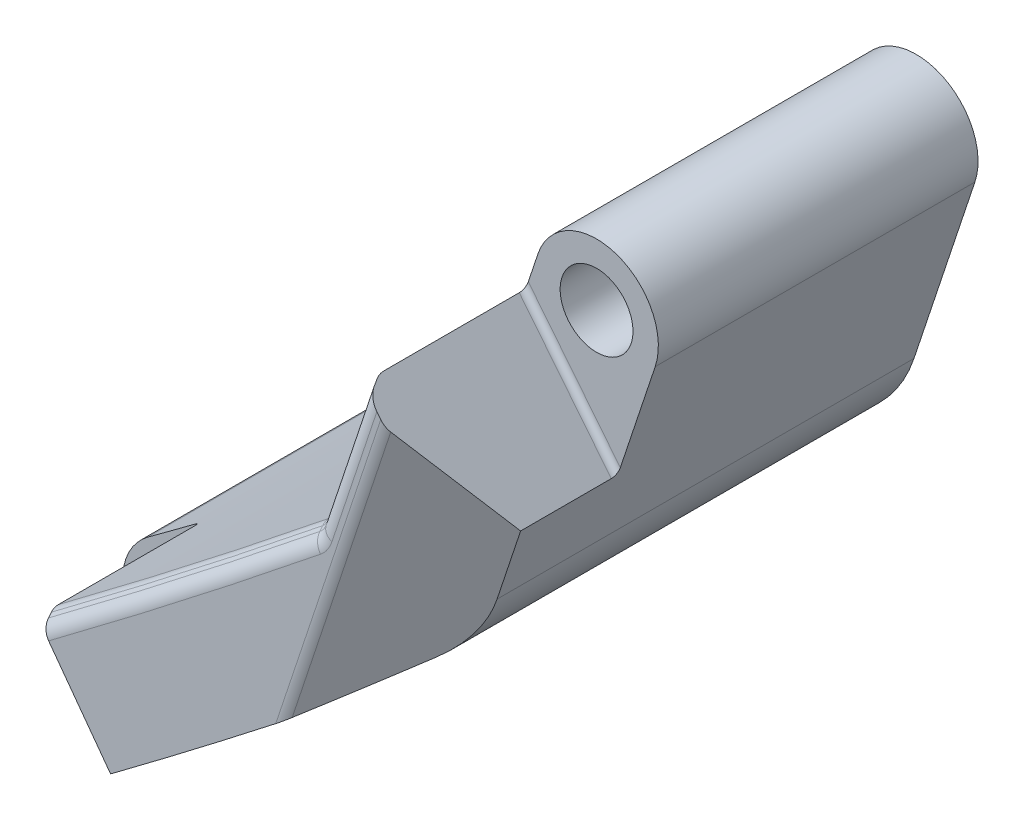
ISO-10303-21;
HEADER;
FILE_DESCRIPTION(('STEP AP214'),'2;1');
FILE_NAME('part.step','',(''),(''),'','','');
FILE_SCHEMA(('AUTOMOTIVE_DESIGN { 1 0 10303 214 1 1 1 1 }'));
ENDSEC;
DATA;
#1=APPLICATION_CONTEXT('core data for automotive mechanical design processes');
#2=APPLICATION_PROTOCOL_DEFINITION('international standard','automotive_design',2000,#1);
#3=PRODUCT_CONTEXT('',#1,'mechanical');
#4=PRODUCT('Part','Part','',(#3));
#5=PRODUCT_RELATED_PRODUCT_CATEGORY('part','',(#4));
#6=PRODUCT_DEFINITION_FORMATION('','',#4);
#7=PRODUCT_DEFINITION_CONTEXT('part definition',#1,'design');
#8=PRODUCT_DEFINITION('design','',#6,#7);
#9=PRODUCT_DEFINITION_SHAPE('','',#8);
#10=(LENGTH_UNIT() NAMED_UNIT(*) SI_UNIT(.MILLI.,.METRE.));
#11=(NAMED_UNIT(*) PLANE_ANGLE_UNIT() SI_UNIT($,.RADIAN.));
#12=(NAMED_UNIT(*) SI_UNIT($,.STERADIAN.) SOLID_ANGLE_UNIT());
#13=UNCERTAINTY_MEASURE_WITH_UNIT(LENGTH_MEASURE(1.E-05),#10,'distance_accuracy_value','');
#14=(GEOMETRIC_REPRESENTATION_CONTEXT(3) GLOBAL_UNCERTAINTY_ASSIGNED_CONTEXT((#13)) GLOBAL_UNIT_ASSIGNED_CONTEXT((#10,
#11,#12)) REPRESENTATION_CONTEXT('',''));
#15=CARTESIAN_POINT('',(0.,0.,0.));
#16=DIRECTION('',(0.,0.,1.));
#17=DIRECTION('',(1.,0.,0.));
#18=AXIS2_PLACEMENT_3D('',#15,#16,#17);
#19=CARTESIAN_POINT('',(-474.213638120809,-43.9648384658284,-31.75));
#20=DIRECTION('',(0.,0.,-1.));
#21=DIRECTION('',(-1.,0.,0.));
#22=AXIS2_PLACEMENT_3D('',#19,#20,#21);
#23=PLANE('',#22);
#24=CARTESIAN_POINT('',(-495.568692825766,-68.0283667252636,-31.75));
#25=DIRECTION('',(0.,0.,1.));
#26=DIRECTION('',(1.,0.,0.));
#27=AXIS2_PLACEMENT_3D('',#24,#25,#26);
#28=CIRCLE('',#27,2.8067);
#29=CARTESIAN_POINT('',(-492.761992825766,-68.0283667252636,-31.75));
#30=VERTEX_POINT('',#29);
#31=EDGE_CURVE('E599',#30,#30,#28,.T.);
#32=ORIENTED_EDGE('',*,*,#31,.T.);
#33=EDGE_LOOP('',(#32));
#34=FACE_BOUND('',#33,.T.);
#35=CARTESIAN_POINT('',(-474.213638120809,-43.9648384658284,-31.75));
#36=DIRECTION('',(0.,0.,-1.));
#37=DIRECTION('',(-1.,0.,0.));
#38=AXIS2_PLACEMENT_3D('',#35,#36,#37);
#39=CIRCLE('',#38,1.26999999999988);
#40=CARTESIAN_POINT('',(-473.008502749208,-44.3655237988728,-31.75));
#41=VERTEX_POINT('',#40);
#42=CARTESIAN_POINT('',(-473.416148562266,-44.9532262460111,-31.75));
#43=VERTEX_POINT('',#42);
#44=EDGE_CURVE('E529',#41,#43,#39,.T.);
#45=ORIENTED_EDGE('',*,*,#44,.F.);
#46=DIRECTION('',(-0.31550026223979,-0.948925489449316,0.));
#47=VECTOR('',#46,1.);
#48=CARTESIAN_POINT('',(-468.314496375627,-30.247430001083,-31.75));
#49=LINE('',#48,#47);
#50=CARTESIAN_POINT('',(-468.314496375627,-30.247430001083,-31.75));
#51=VERTEX_POINT('',#50);
#52=EDGE_CURVE('E250',#51,#41,#49,.T.);
#53=ORIENTED_EDGE('',*,*,#52,.F.);
#54=CARTESIAN_POINT('',(-463.795238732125,-31.75,-31.75));
#55=DIRECTION('',(0.,0.,1.));
#56=DIRECTION('',(1.,0.,0.));
#57=AXIS2_PLACEMENT_3D('',#54,#55,#56);
#58=CIRCLE('',#57,4.76250000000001);
#59=CARTESIAN_POINT('',(-459.275981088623,-33.252569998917,-31.75));
#60=VERTEX_POINT('',#59);
#61=EDGE_CURVE('E567',#60,#51,#58,.T.);
#62=ORIENTED_EDGE('',*,*,#61,.F.);
#63=DIRECTION('',(0.31550026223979,0.948925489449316,0.));
#64=VECTOR('',#63,1.);
#65=CARTESIAN_POINT('',(-459.275981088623,-33.252569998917,-31.75));
#66=LINE('',#65,#64);
#67=CARTESIAN_POINT('',(-463.969987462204,-47.3706637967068,-31.75));
#68=VERTEX_POINT('',#67);
#69=EDGE_CURVE('E571',#68,#60,#66,.T.);
#70=ORIENTED_EDGE('',*,*,#69,.F.);
#71=CARTESIAN_POINT('',(-474.213638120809,-43.9648384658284,-31.75));
#72=DIRECTION('',(0.,0.,1.));
#73=DIRECTION('',(-1.,0.,0.));
#74=AXIS2_PLACEMENT_3D('',#71,#72,#73);
#75=CIRCLE('',#74,10.7949999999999);
#76=CARTESIAN_POINT('',(-467.434976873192,-52.3661345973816,-31.75));
#77=VERTEX_POINT('',#76);
#78=EDGE_CURVE('E550',#77,#68,#75,.T.);
#79=ORIENTED_EDGE('',*,*,#78,.F.);
#80=CARTESIAN_POINT('',(-912.977322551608,499.827439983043,-31.75));
#81=DIRECTION('',(0.,0.,1.));
#82=DIRECTION('',(1.,0.,0.));
#83=AXIS2_PLACEMENT_3D('',#80,#81,#82);
#84=CIRCLE('',#83,709.524999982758);
#85=CARTESIAN_POINT('',(-492.748014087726,-71.8657066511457,-31.75));
#86=VERTEX_POINT('',#85);
#87=EDGE_CURVE('E576',#86,#77,#84,.T.);
#88=ORIENTED_EDGE('',*,*,#87,.F.);
#89=CARTESIAN_POINT('',(-495.568692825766,-68.0283667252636,-31.75));
#90=DIRECTION('',(0.,0.,1.));
#91=DIRECTION('',(1.,0.,0.));
#92=AXIS2_PLACEMENT_3D('',#89,#90,#91);
#93=CIRCLE('',#92,4.76250000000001);
#94=CARTESIAN_POINT('',(-498.389371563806,-64.1910267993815,-31.75));
#95=VERTEX_POINT('',#94);
#96=EDGE_CURVE('E232',#95,#86,#93,.T.);
#97=ORIENTED_EDGE('',*,*,#96,.F.);
#98=CARTESIAN_POINT('',(-912.977322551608,499.827439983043,-31.75));
#99=DIRECTION('',(0.,0.,-1.));
#100=DIRECTION('',(1.,0.,0.));
#101=AXIS2_PLACEMENT_3D('',#98,#99,#100);
#102=CIRCLE('',#101,699.999999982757);
#103=EDGE_CURVE('E581',#43,#95,#102,.T.);
#104=ORIENTED_EDGE('',*,*,#103,.F.);
#105=EDGE_LOOP('',(#45,#53,#62,#70,#79,#88,#97,#104));
#106=FACE_BOUND('',#105,.T.);
#107=CARTESIAN_POINT('',(-463.795238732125,-31.75,-31.75));
#108=DIRECTION('',(0.,0.,1.));
#109=DIRECTION('',(1.,0.,0.));
#110=AXIS2_PLACEMENT_3D('',#107,#108,#109);
#111=CIRCLE('',#110,2.8067);
#112=CARTESIAN_POINT('',(-460.988538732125,-31.75,-31.75));
#113=VERTEX_POINT('',#112);
#114=EDGE_CURVE('E591',#113,#113,#111,.T.);
#115=ORIENTED_EDGE('',*,*,#114,.T.);
#116=EDGE_LOOP('',(#115));
#117=FACE_BOUND('',#116,.T.);
#118=ADVANCED_FACE('F49',(#34,#106,#117),#23,.T.);
#119=CARTESIAN_POINT('',(-474.213638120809,-43.9648384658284,-31.75));
#120=DIRECTION('',(0.,0.,1.));
#121=DIRECTION('',(1.,0.,0.));
#122=AXIS2_PLACEMENT_3D('',#119,#120,#121);
#123=CYLINDRICAL_SURFACE('',#122,1.26999999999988);
#124=DIRECTION('',(0.,0.,1.));
#125=VECTOR('',#124,1.);
#126=CARTESIAN_POINT('',(-473.416148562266,-44.9532262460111,-31.75));
#127=LINE('',#126,#125);
#128=CARTESIAN_POINT('',(-473.416148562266,-44.9532262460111,3.85070452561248));
#129=VERTEX_POINT('',#128);
#130=EDGE_CURVE('E243',#43,#129,#127,.T.);
#131=ORIENTED_EDGE('',*,*,#130,.T.);
#132=CARTESIAN_POINT('',(-474.213638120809,-43.9648384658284,3.85070452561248));
#133=DIRECTION('',(0.,0.,-1.));
#134=DIRECTION('',(-1.,0.,0.));
#135=AXIS2_PLACEMENT_3D('',#132,#133,#134);
#136=CIRCLE('',#135,1.26999999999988);
#137=CARTESIAN_POINT('',(-473.008502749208,-44.3655237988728,3.8507045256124));
#138=VERTEX_POINT('',#137);
#139=EDGE_CURVE('E463',#129,#138,#136,.F.);
#140=ORIENTED_EDGE('',*,*,#139,.T.);
#141=DIRECTION('',(0.,0.,1.));
#142=VECTOR('',#141,1.);
#143=CARTESIAN_POINT('',(-473.008502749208,-44.3655237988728,-31.75));
#144=LINE('',#143,#142);
#145=EDGE_CURVE('E271',#41,#138,#144,.T.);
#146=ORIENTED_EDGE('',*,*,#145,.F.);
#147=ORIENTED_EDGE('',*,*,#44,.T.);
#148=EDGE_LOOP('',(#131,#140,#146,#147));
#149=FACE_BOUND('',#148,.T.);
#150=ADVANCED_FACE('F307',(#149),#123,.F.);
#151=CARTESIAN_POINT('',(-468.314496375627,-30.247430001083,-31.75));
#152=DIRECTION('',(-0.948925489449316,0.31550026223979,0.));
#153=DIRECTION('',(-0.31550026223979,-0.948925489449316,0.));
#154=AXIS2_PLACEMENT_3D('',#151,#152,#153);
#155=PLANE('',#154);
#156=ORIENTED_EDGE('',*,*,#145,.T.);
#157=DIRECTION('',(0.31550026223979,0.948925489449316,0.));
#158=VECTOR('',#157,1.);
#159=CARTESIAN_POINT('',(-468.314496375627,-30.247430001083,3.8507045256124));
#160=LINE('',#159,#158);
#161=CARTESIAN_POINT('',(-469.245825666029,-33.0485753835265,3.85070452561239));
#162=VERTEX_POINT('',#161);
#163=EDGE_CURVE('E444',#138,#162,#160,.T.);
#164=ORIENTED_EDGE('',*,*,#163,.T.);
#165=DIRECTION('',(0.,0.,1.));
#166=VECTOR('',#165,1.);
#167=CARTESIAN_POINT('',(-469.245825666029,-33.0485753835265,-31.75));
#168=LINE('',#167,#166);
#169=CARTESIAN_POINT('',(-469.245825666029,-33.0485753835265,-6.60400000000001));
#170=VERTEX_POINT('',#169);
#171=EDGE_CURVE('E257',#170,#162,#168,.T.);
#172=ORIENTED_EDGE('',*,*,#171,.F.);
#173=CARTESIAN_POINT('',(-469.05483615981,-32.4741390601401,-6.604));
#174=DIRECTION('',(-0.948925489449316,0.31550026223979,0.));
#175=DIRECTION('',(0.31550026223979,0.948925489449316,0.));
#176=AXIS2_PLACEMENT_3D('',#173,#174,#175);
#177=ELLIPSE('',#176,0.605354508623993,0.508);
#178=CARTESIAN_POINT('',(-469.05483615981,-32.4741390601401,-7.112));
#179=VERTEX_POINT('',#178);
#180=EDGE_CURVE('E510',#170,#179,#177,.F.);
#181=ORIENTED_EDGE('',*,*,#180,.T.);
#182=DIRECTION('',(-0.315500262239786,-0.948925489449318,0.));
#183=VECTOR('',#182,1.);
#184=CARTESIAN_POINT('',(-468.314496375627,-30.247430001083,-7.112));
#185=LINE('',#184,#183);
#186=CARTESIAN_POINT('',(-468.314496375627,-30.247430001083,-7.112));
#187=VERTEX_POINT('',#186);
#188=EDGE_CURVE('E261',#187,#179,#185,.T.);
#189=ORIENTED_EDGE('',*,*,#188,.F.);
#190=DIRECTION('',(0.,0.,1.));
#191=VECTOR('',#190,1.);
#192=CARTESIAN_POINT('',(-468.314496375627,-30.247430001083,-31.75));
#193=LINE('',#192,#191);
#194=EDGE_CURVE('E556',#51,#187,#193,.T.);
#195=ORIENTED_EDGE('',*,*,#194,.F.);
#196=ORIENTED_EDGE('',*,*,#52,.T.);
#197=EDGE_LOOP('',(#156,#164,#172,#181,#189,#195,#196));
#198=FACE_BOUND('',#197,.T.);
#199=ADVANCED_FACE('F310',(#198),#155,.T.);
#200=CARTESIAN_POINT('',(-463.795238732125,-31.75,-31.75));
#201=DIRECTION('',(0.,0.,1.));
#202=DIRECTION('',(1.,0.,0.));
#203=AXIS2_PLACEMENT_3D('',#200,#201,#202);
#204=CYLINDRICAL_SURFACE('',#203,4.76250000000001);
#205=CARTESIAN_POINT('',(-463.795238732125,-31.75,-7.112));
#206=DIRECTION('',(0.,0.,-1.));
#207=DIRECTION('',(-1.,0.,0.));
#208=AXIS2_PLACEMENT_3D('',#205,#206,#207);
#209=CIRCLE('',#208,4.76249999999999);
#210=CARTESIAN_POINT('',(-459.275981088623,-33.252569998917,-7.112));
#211=VERTEX_POINT('',#210);
#212=EDGE_CURVE('E503',#211,#187,#209,.F.);
#213=ORIENTED_EDGE('',*,*,#212,.F.);
#214=DIRECTION('',(0.,0.,1.));
#215=VECTOR('',#214,1.);
#216=CARTESIAN_POINT('',(-459.275981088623,-33.252569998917,-31.75));
#217=LINE('',#216,#215);
#218=EDGE_CURVE('E552',#60,#211,#217,.T.);
#219=ORIENTED_EDGE('',*,*,#218,.F.);
#220=ORIENTED_EDGE('',*,*,#61,.T.);
#221=ORIENTED_EDGE('',*,*,#194,.T.);
#222=EDGE_LOOP('',(#213,#219,#220,#221));
#223=FACE_BOUND('',#222,.T.);
#224=ADVANCED_FACE('F383',(#223),#204,.T.);
#225=CARTESIAN_POINT('',(-459.275981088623,-33.252569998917,-31.75));
#226=DIRECTION('',(0.948925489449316,-0.31550026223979,0.));
#227=DIRECTION('',(0.31550026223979,0.948925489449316,0.));
#228=AXIS2_PLACEMENT_3D('',#225,#226,#227);
#229=PLANE('',#228);
#230=DIRECTION('',(0.,0.,1.));
#231=VECTOR('',#230,1.);
#232=CARTESIAN_POINT('',(-462.154892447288,-41.9114292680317,-24.61486789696));
#233=LINE('',#232,#231);
#234=CARTESIAN_POINT('',(-462.154892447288,-41.9114292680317,-6.60400000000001));
#235=VERTEX_POINT('',#234);
#236=CARTESIAN_POINT('',(-462.154892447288,-41.9114292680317,0.380999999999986));
#237=VERTEX_POINT('',#236);
#238=EDGE_CURVE('E262',#235,#237,#233,.T.);
#239=ORIENTED_EDGE('',*,*,#238,.T.);
#240=DIRECTION('',(-0.31550026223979,-0.948925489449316,0.));
#241=VECTOR('',#240,1.);
#242=CARTESIAN_POINT('',(-463.969987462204,-47.3706637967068,0.380999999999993));
#243=LINE('',#242,#241);
#244=CARTESIAN_POINT('',(-463.969987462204,-47.3706637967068,0.380999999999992));
#245=VERTEX_POINT('',#244);
#246=EDGE_CURVE('E492',#237,#245,#243,.T.);
#247=ORIENTED_EDGE('',*,*,#246,.T.);
#248=DIRECTION('',(0.,0.,1.));
#249=VECTOR('',#248,1.);
#250=CARTESIAN_POINT('',(-463.969987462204,-47.3706637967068,-31.75));
#251=LINE('',#250,#249);
#252=EDGE_CURVE('E241',#68,#245,#251,.T.);
#253=ORIENTED_EDGE('',*,*,#252,.F.);
#254=ORIENTED_EDGE('',*,*,#69,.T.);
#255=ORIENTED_EDGE('',*,*,#218,.T.);
#256=DIRECTION('',(0.315500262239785,0.948925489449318,0.));
#257=VECTOR('',#256,1.);
#258=CARTESIAN_POINT('',(-461.963902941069,-41.3369929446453,-7.112));
#259=LINE('',#258,#257);
#260=CARTESIAN_POINT('',(-461.963902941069,-41.3369929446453,-7.112));
#261=VERTEX_POINT('',#260);
#262=EDGE_CURVE('E266',#261,#211,#259,.T.);
#263=ORIENTED_EDGE('',*,*,#262,.F.);
#264=CARTESIAN_POINT('',(-461.963902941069,-41.3369929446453,-6.604));
#265=DIRECTION('',(0.948925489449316,-0.31550026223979,0.));
#266=DIRECTION('',(0.31550026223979,0.948925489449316,0.));
#267=AXIS2_PLACEMENT_3D('',#264,#265,#266);
#268=ELLIPSE('',#267,0.605354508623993,0.508);
#269=EDGE_CURVE('E513',#261,#235,#268,.F.);
#270=ORIENTED_EDGE('',*,*,#269,.T.);
#271=EDGE_LOOP('',(#239,#247,#253,#254,#255,#263,#270));
#272=FACE_BOUND('',#271,.T.);
#273=ADVANCED_FACE('F387',(#272),#229,.T.);
#274=CARTESIAN_POINT('',(-474.213638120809,-43.9648384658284,-31.75));
#275=DIRECTION('',(0.,0.,1.));
#276=DIRECTION('',(1.,0.,0.));
#277=AXIS2_PLACEMENT_3D('',#274,#275,#276);
#278=CYLINDRICAL_SURFACE('',#277,10.7949999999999);
#279=ORIENTED_EDGE('',*,*,#252,.T.);
#280=CARTESIAN_POINT('',(-474.213638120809,-43.9648384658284,7.93974037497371));
#281=DIRECTION('',(0.54428130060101,-0.180963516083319,0.819152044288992));
#282=DIRECTION('',(-0.77731425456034,0.258442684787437,0.573576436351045));
#283=AXIS2_PLACEMENT_3D('',#280,#281,#282);
#284=ELLIPSE('',#283,13.1782616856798,10.7949999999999);
#285=CARTESIAN_POINT('',(-467.434976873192,-52.3661345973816,1.57971639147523));
#286=VERTEX_POINT('',#285);
#287=EDGE_CURVE('E487',#245,#286,#284,.F.);
#288=ORIENTED_EDGE('',*,*,#287,.T.);
#289=DIRECTION('',(0.,0.,1.));
#290=VECTOR('',#289,1.);
#291=CARTESIAN_POINT('',(-467.434976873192,-52.3661345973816,-31.75));
#292=LINE('',#291,#290);
#293=EDGE_CURVE('E234',#77,#286,#292,.T.);
#294=ORIENTED_EDGE('',*,*,#293,.F.);
#295=ORIENTED_EDGE('',*,*,#78,.T.);
#296=EDGE_LOOP('',(#279,#288,#294,#295));
#297=FACE_BOUND('',#296,.T.);
#298=ADVANCED_FACE('F391',(#297),#278,.T.);
#299=CARTESIAN_POINT('',(-912.977322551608,499.827439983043,-31.75));
#300=DIRECTION('',(0.,0.,1.));
#301=DIRECTION('',(1.,0.,0.));
#302=AXIS2_PLACEMENT_3D('',#299,#300,#301);
#303=CYLINDRICAL_SURFACE('',#302,709.524999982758);
#304=CARTESIAN_POINT('',(-912.977322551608,499.827439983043,419.606211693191));
#305=DIRECTION('',(0.54428130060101,-0.180963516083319,0.819152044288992));
#306=DIRECTION('',(-0.77731425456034,0.258442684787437,0.573576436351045));
#307=AXIS2_PLACEMENT_3D('',#304,#305,#306);
#308=ELLIPSE('',#307,866.170090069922,709.524999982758);
#309=CARTESIAN_POINT('',(-474.907998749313,-58.3132171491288,5.23132309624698));
#310=VERTEX_POINT('',#309);
#311=EDGE_CURVE('E482',#286,#310,#308,.F.);
#312=ORIENTED_EDGE('',*,*,#311,.T.);
#313=CARTESIAN_POINT('',(-474.907998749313,-58.3132171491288,5.23132309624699));
#314=CARTESIAN_POINT('',(-474.942375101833,-58.340198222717,5.24819789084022));
#315=CARTESIAN_POINT('',(-474.977070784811,-58.3674247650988,5.2639942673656));
#316=CARTESIAN_POINT('',(-475.046990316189,-58.4222816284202,5.29354812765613));
#317=CARTESIAN_POINT('',(-475.082214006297,-58.4499118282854,5.3073062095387));
#318=CARTESIAN_POINT('',(-475.188481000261,-58.5332533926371,5.34569163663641));
#319=CARTESIAN_POINT('',(-475.260179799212,-58.5894624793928,5.36745881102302));
#320=CARTESIAN_POINT('',(-475.403775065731,-58.701990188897,5.4037819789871));
#321=CARTESIAN_POINT('',(-475.475658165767,-58.7582988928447,5.41842367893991));
#322=CARTESIAN_POINT('',(-475.620068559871,-58.8713754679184,5.44129209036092));
#323=CARTESIAN_POINT('',(-475.692595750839,-58.9281432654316,5.44951981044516));
#324=CARTESIAN_POINT('',(-475.795307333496,-59.0085043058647,5.4567614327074));
#325=CARTESIAN_POINT('',(-475.825382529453,-59.0320310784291,5.45834909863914));
#326=CARTESIAN_POINT('',(-475.885638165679,-59.0791591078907,5.46046944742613));
#327=CARTESIAN_POINT('',(-475.915818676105,-59.1027603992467,5.46099937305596));
#328=CARTESIAN_POINT('',(-475.946003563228,-59.1263611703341,5.461));
#329=B_SPLINE_CURVE_WITH_KNOTS('',3,(#313,#314,#315,#316,#317,#318,#319,#320,#321,#322,#323,
#324,#325,#326,#327,#328),.UNSPECIFIED.,.F.,.F.,(4,2,2,2,2,2,2,4),(0.,0.140500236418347,
0.280959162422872,0.561634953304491,0.838845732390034,1.11601291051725,1.2306528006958,
1.34559113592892),.UNSPECIFIED.);
#330=CARTESIAN_POINT('',(-475.946003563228,-59.1263611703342,5.461));
#331=VERTEX_POINT('',#330);
#332=EDGE_CURVE('E12',#310,#331,#329,.T.);
#333=ORIENTED_EDGE('',*,*,#332,.T.);
#334=CARTESIAN_POINT('',(-912.977322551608,499.827439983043,5.461));
#335=DIRECTION('',(0.,0.,-1.));
#336=DIRECTION('',(-1.,0.,0.));
#337=AXIS2_PLACEMENT_3D('',#334,#335,#336);
#338=CIRCLE('',#337,709.524999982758);
#339=CARTESIAN_POINT('',(-488.675801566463,-68.8499245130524,5.461));
#340=VERTEX_POINT('',#339);
#341=EDGE_CURVE('E526',#340,#331,#338,.F.);
#342=ORIENTED_EDGE('',*,*,#341,.F.);
#343=DIRECTION('',(0.,0.,1.));
#344=VECTOR('',#343,1.);
#345=CARTESIAN_POINT('',(-488.675801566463,-68.8499245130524,-31.75));
#346=LINE('',#345,#344);
#347=CARTESIAN_POINT('',(-488.675801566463,-68.8499245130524,-6.604));
#348=VERTEX_POINT('',#347);
#349=EDGE_CURVE('E227',#348,#340,#346,.T.);
#350=ORIENTED_EDGE('',*,*,#349,.F.);
#351=CARTESIAN_POINT('',(-488.675801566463,-68.8499245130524,-6.604));
#352=CARTESIAN_POINT('',(-488.675782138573,-68.8499099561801,-6.6325787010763));
#353=CARTESIAN_POINT('',(-488.677733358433,-68.851365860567,-6.66115014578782));
#354=CARTESIAN_POINT('',(-488.68543372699,-68.857111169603,-6.71746293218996));
#355=CARTESIAN_POINT('',(-488.691179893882,-68.861398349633,-6.74520490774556));
#356=CARTESIAN_POINT('',(-488.706330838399,-68.8727018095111,-6.7991034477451));
#357=CARTESIAN_POINT('',(-488.715737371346,-68.8797193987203,-6.82525924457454));
#358=CARTESIAN_POINT('',(-488.737934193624,-68.8962777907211,-6.8752251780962));
#359=CARTESIAN_POINT('',(-488.750723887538,-68.9058181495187,-6.89903572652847));
#360=CARTESIAN_POINT('',(-488.779326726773,-68.9271523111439,-6.94364036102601));
#361=CARTESIAN_POINT('',(-488.795139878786,-68.9389461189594,-6.96443444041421));
#362=CARTESIAN_POINT('',(-488.829344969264,-68.9644544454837,-7.00241989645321));
#363=CARTESIAN_POINT('',(-488.847737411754,-68.9781693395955,-7.01961056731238));
#364=CARTESIAN_POINT('',(-488.886578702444,-69.0071292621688,-7.04989890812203));
#365=CARTESIAN_POINT('',(-488.9070280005,-69.0223746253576,-7.06299568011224));
#366=CARTESIAN_POINT('',(-488.949396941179,-69.053957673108,-7.08471442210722));
#367=CARTESIAN_POINT('',(-488.971315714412,-69.0702947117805,-7.09333901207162));
#368=CARTESIAN_POINT('',(-489.008319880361,-69.0978720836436,-7.10372561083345));
#369=CARTESIAN_POINT('',(-489.02317195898,-69.1089397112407,-7.10682663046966));
#370=CARTESIAN_POINT('',(-489.053039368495,-69.1311947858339,-7.11096355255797));
#371=CARTESIAN_POINT('',(-489.068054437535,-69.1423820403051,-7.11200238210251));
#372=CARTESIAN_POINT('',(-489.083076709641,-69.1535737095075,-7.112));
#373=B_SPLINE_CURVE_WITH_KNOTS('',3,(#351,#352,#353,#354,#355,#356,#357,#358,#359,#360,#361,
#362,#363,#364,#365,#366,#367,#368,#369,#370,#371,#372),.UNSPECIFIED.,.F.,.F.,(4,2,2,2,2,2,2,2,
2,2,4),(0.,0.0856221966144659,0.171177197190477,0.256773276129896,0.34235430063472,
0.427935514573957,0.513533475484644,0.599150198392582,0.684716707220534,0.740950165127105,
0.797103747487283),.UNSPECIFIED.);
#374=CARTESIAN_POINT('',(-489.083076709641,-69.1535737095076,-7.112));
#375=VERTEX_POINT('',#374);
#376=EDGE_CURVE('E225',#348,#375,#373,.T.);
#377=ORIENTED_EDGE('',*,*,#376,.T.);
#378=CARTESIAN_POINT('',(-912.977322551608,499.827439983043,-7.112));
#379=DIRECTION('',(0.,0.,-1.));
#380=DIRECTION('',(-1.,0.,0.));
#381=AXIS2_PLACEMENT_3D('',#378,#379,#380);
#382=CIRCLE('',#381,709.524999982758);
#383=CARTESIAN_POINT('',(-492.748014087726,-71.8657066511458,-7.11200000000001));
#384=VERTEX_POINT('',#383);
#385=EDGE_CURVE('E208',#384,#375,#382,.F.);
#386=ORIENTED_EDGE('',*,*,#385,.F.);
#387=DIRECTION('',(0.,0.,1.));
#388=VECTOR('',#387,1.);
#389=CARTESIAN_POINT('',(-492.748014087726,-71.8657066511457,-31.75));
#390=LINE('',#389,#388);
#391=EDGE_CURVE('E221',#86,#384,#390,.T.);
#392=ORIENTED_EDGE('',*,*,#391,.F.);
#393=ORIENTED_EDGE('',*,*,#87,.T.);
#394=ORIENTED_EDGE('',*,*,#293,.T.);
#395=EDGE_LOOP('',(#312,#333,#342,#350,#377,#386,#392,#393,#394));
#396=FACE_BOUND('',#395,.T.);
#397=ADVANCED_FACE('F219',(#396),#303,.T.);
#398=CARTESIAN_POINT('',(-495.568692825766,-68.0283667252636,-31.75));
#399=DIRECTION('',(0.,0.,1.));
#400=DIRECTION('',(1.,0.,0.));
#401=AXIS2_PLACEMENT_3D('',#398,#399,#400);
#402=CYLINDRICAL_SURFACE('',#401,4.76250000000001);
#403=CARTESIAN_POINT('',(-495.568692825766,-68.0283667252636,-7.112));
#404=DIRECTION('',(0.,0.,-1.));
#405=DIRECTION('',(-1.,0.,0.));
#406=AXIS2_PLACEMENT_3D('',#403,#404,#405);
#407=CIRCLE('',#406,4.76249999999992);
#408=CARTESIAN_POINT('',(-498.389371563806,-64.1910267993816,-7.112));
#409=VERTEX_POINT('',#408);
#410=EDGE_CURVE('E204',#409,#384,#407,.F.);
#411=ORIENTED_EDGE('',*,*,#410,.F.);
#412=DIRECTION('',(0.,0.,1.));
#413=VECTOR('',#412,1.);
#414=CARTESIAN_POINT('',(-498.389371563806,-64.1910267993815,-31.75));
#415=LINE('',#414,#413);
#416=EDGE_CURVE('E235',#95,#409,#415,.T.);
#417=ORIENTED_EDGE('',*,*,#416,.F.);
#418=ORIENTED_EDGE('',*,*,#96,.T.);
#419=ORIENTED_EDGE('',*,*,#391,.T.);
#420=EDGE_LOOP('',(#411,#417,#418,#419));
#421=FACE_BOUND('',#420,.T.);
#422=ADVANCED_FACE('F230',(#421),#402,.T.);
#423=CARTESIAN_POINT('',(-912.977322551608,499.827439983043,-31.75));
#424=DIRECTION('',(0.,0.,1.));
#425=DIRECTION('',(1.,0.,0.));
#426=AXIS2_PLACEMENT_3D('',#423,#424,#425);
#427=CYLINDRICAL_SURFACE('',#426,699.999999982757);
#428=DIRECTION('',(0.,0.,1.));
#429=VECTOR('',#428,1.);
#430=CARTESIAN_POINT('',(-494.317304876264,-61.1750462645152,-7.112));
#431=LINE('',#430,#429);
#432=CARTESIAN_POINT('',(-494.317304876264,-61.1750462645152,-6.604));
#433=VERTEX_POINT('',#432);
#434=CARTESIAN_POINT('',(-494.317304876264,-61.1750462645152,3.85070452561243));
#435=VERTEX_POINT('',#434);
#436=EDGE_CURVE('E253',#433,#435,#431,.T.);
#437=ORIENTED_EDGE('',*,*,#436,.T.);
#438=CARTESIAN_POINT('',(-912.977322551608,499.827439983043,3.85070452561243));
#439=DIRECTION('',(0.,0.,-1.));
#440=DIRECTION('',(-1.,0.,0.));
#441=AXIS2_PLACEMENT_3D('',#438,#439,#440);
#442=CIRCLE('',#441,699.999999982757);
#443=EDGE_CURVE('E478',#435,#129,#442,.F.);
#444=ORIENTED_EDGE('',*,*,#443,.T.);
#445=ORIENTED_EDGE('',*,*,#130,.F.);
#446=ORIENTED_EDGE('',*,*,#103,.T.);
#447=ORIENTED_EDGE('',*,*,#416,.T.);
#448=CARTESIAN_POINT('',(-912.977322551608,499.827439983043,-7.112));
#449=DIRECTION('',(0.,0.,-1.));
#450=DIRECTION('',(-1.,0.,0.));
#451=AXIS2_PLACEMENT_3D('',#448,#449,#450);
#452=CIRCLE('',#451,699.999999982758);
#453=CARTESIAN_POINT('',(-494.724552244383,-61.4787332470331,-7.112));
#454=VERTEX_POINT('',#453);
#455=EDGE_CURVE('E211',#454,#409,#452,.T.);
#456=ORIENTED_EDGE('',*,*,#455,.F.);
#457=CARTESIAN_POINT('',(-494.724552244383,-61.4787332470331,-7.112));
#458=CARTESIAN_POINT('',(-494.701634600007,-61.4616564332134,-7.11202427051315));
#459=CARTESIAN_POINT('',(-494.678723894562,-61.4445824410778,-7.10958963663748));
#460=CARTESIAN_POINT('',(-494.633570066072,-61.4109278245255,-7.09998166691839));
#461=CARTESIAN_POINT('',(-494.611326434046,-61.3943468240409,-7.0928120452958));
#462=CARTESIAN_POINT('',(-494.568112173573,-61.3621299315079,-7.07390815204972));
#463=CARTESIAN_POINT('',(-494.54714216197,-61.346494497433,-7.06217168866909));
#464=CARTESIAN_POINT('',(-494.507084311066,-61.3166237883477,-7.03447747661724));
#465=CARTESIAN_POINT('',(-494.48799614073,-61.3023882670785,-7.0185204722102));
#466=CARTESIAN_POINT('',(-494.452239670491,-61.275719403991,-6.98283559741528));
#467=CARTESIAN_POINT('',(-494.435571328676,-61.2632860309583,-6.96310779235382));
#468=CARTESIAN_POINT('',(-494.405123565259,-61.2405724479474,-6.92043646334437));
#469=CARTESIAN_POINT('',(-494.391344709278,-61.2302926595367,-6.89749231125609));
#470=CARTESIAN_POINT('',(-494.367069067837,-61.2121806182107,-6.84904168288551));
#471=CARTESIAN_POINT('',(-494.3565728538,-61.2043487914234,-6.82353476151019));
#472=CARTESIAN_POINT('',(-494.339167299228,-61.1913610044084,-6.77068928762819));
#473=CARTESIAN_POINT('',(-494.332255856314,-61.1862034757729,-6.74335181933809));
#474=CARTESIAN_POINT('',(-494.323933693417,-61.1799931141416,-6.69720582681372));
#475=CARTESIAN_POINT('',(-494.321449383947,-61.1781391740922,-6.6786876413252));
#476=CARTESIAN_POINT('',(-494.318135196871,-61.1756659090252,-6.64144889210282));
#477=CARTESIAN_POINT('',(-494.317302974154,-61.1750448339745,-6.62272865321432));
#478=CARTESIAN_POINT('',(-494.317304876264,-61.175046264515,-6.604));
#479=B_SPLINE_CURVE_WITH_KNOTS('',3,(#457,#458,#459,#460,#461,#462,#463,#464,#465,#466,#467,
#468,#469,#470,#471,#472,#473,#474,#475,#476,#477,#478),.UNSPECIFIED.,.F.,.F.,(4,2,2,2,2,2,2,2,
2,2,4),(0.,0.0856271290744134,0.171187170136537,0.256788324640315,0.342374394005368,
0.427958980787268,0.51356030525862,0.59917652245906,0.684742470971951,0.740963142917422,
0.797103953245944),.UNSPECIFIED.);
#480=EDGE_CURVE('E281',#454,#433,#479,.T.);
#481=ORIENTED_EDGE('',*,*,#480,.T.);
#482=EDGE_LOOP('',(#437,#444,#445,#446,#447,#456,#481));
#483=FACE_BOUND('',#482,.T.);
#484=ADVANCED_FACE('F300',(#483),#427,.F.);
#485=CARTESIAN_POINT('',(-474.213638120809,-43.9648384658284,5.461));
#486=DIRECTION('',(0.,0.,-1.));
#487=DIRECTION('',(-1.,0.,0.));
#488=AXIS2_PLACEMENT_3D('',#485,#486,#487);
#489=PLANE('',#488);
#490=ORIENTED_EDGE('',*,*,#341,.T.);
#491=DIRECTION('',(0.31550026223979,0.948925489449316,0.));
#492=VECTOR('',#491,1.);
#493=CARTESIAN_POINT('',(-467.935884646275,-35.034444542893,5.461));
#494=LINE('',#493,#492);
#495=CARTESIAN_POINT('',(-467.854008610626,-34.7881871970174,5.461));
#496=VERTEX_POINT('',#495);
#497=EDGE_CURVE('E447',#331,#496,#494,.T.);
#498=ORIENTED_EDGE('',*,*,#497,.T.);
#499=DIRECTION('',(0.624729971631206,-0.780840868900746,0.));
#500=VECTOR('',#499,1.);
#501=CARTESIAN_POINT('',(-462.360570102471,-41.6543557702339,5.461));
#502=LINE('',#501,#500);
#503=CARTESIAN_POINT('',(-468.154105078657,-34.4131010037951,5.461));
#504=VERTEX_POINT('',#503);
#505=EDGE_CURVE('E522',#504,#496,#502,.T.);
#506=ORIENTED_EDGE('',*,*,#505,.F.);
#507=DIRECTION('',(-0.31550026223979,-0.948925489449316,0.));
#508=VECTOR('',#507,1.);
#509=CARTESIAN_POINT('',(-471.616932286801,-44.82819536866,5.461));
#510=LINE('',#509,#508);
#511=CARTESIAN_POINT('',(-471.616932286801,-44.82819536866,5.461));
#512=VERTEX_POINT('',#511);
#513=EDGE_CURVE('E428',#504,#512,#510,.T.);
#514=ORIENTED_EDGE('',*,*,#513,.T.);
#515=CARTESIAN_POINT('',(-474.213638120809,-43.9648384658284,5.461));
#516=DIRECTION('',(0.,0.,-1.));
#517=DIRECTION('',(-1.,0.,0.));
#518=AXIS2_PLACEMENT_3D('',#515,#516,#517);
#519=CIRCLE('',#518,2.73646968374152);
#520=CARTESIAN_POINT('',(-472.495286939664,-46.0945181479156,5.461));
#521=VERTEX_POINT('',#520);
#522=EDGE_CURVE('E426',#512,#521,#519,.T.);
#523=ORIENTED_EDGE('',*,*,#522,.T.);
#524=CARTESIAN_POINT('',(-912.977322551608,499.827439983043,5.461));
#525=DIRECTION('',(0.,0.,-1.));
#526=DIRECTION('',(-1.,0.,0.));
#527=AXIS2_PLACEMENT_3D('',#524,#525,#526);
#528=CIRCLE('',#527,701.466469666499);
#529=CARTESIAN_POINT('',(-493.44873836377,-62.3566714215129,5.461));
#530=VERTEX_POINT('',#529);
#531=EDGE_CURVE('E451',#521,#530,#528,.T.);
#532=ORIENTED_EDGE('',*,*,#531,.T.);
#533=DIRECTION('',(-0.592268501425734,0.805740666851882,0.));
#534=VECTOR('',#533,1.);
#535=CARTESIAN_POINT('',(-494.315235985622,-61.1778608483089,5.461));
#536=LINE('',#535,#534);
#537=EDGE_CURVE('E216',#340,#530,#536,.T.);
#538=ORIENTED_EDGE('',*,*,#537,.F.);
#539=EDGE_LOOP('',(#490,#498,#506,#514,#523,#532,#538));
#540=FACE_BOUND('',#539,.T.);
#541=ADVANCED_FACE('F305',(#540),#489,.F.);
#542=CARTESIAN_POINT('',(-460.988538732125,-31.75,-7.112));
#543=DIRECTION('',(0.,0.,-1.));
#544=DIRECTION('',(-1.,0.,0.));
#545=AXIS2_PLACEMENT_3D('',#542,#543,#544);
#546=PLANE('',#545);
#547=CARTESIAN_POINT('',(-463.795238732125,-31.75,-7.112));
#548=DIRECTION('',(0.,0.,1.));
#549=DIRECTION('',(1.,0.,0.));
#550=AXIS2_PLACEMENT_3D('',#547,#548,#549);
#551=CIRCLE('',#550,2.8067);
#552=CARTESIAN_POINT('',(-460.988538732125,-31.75,-7.112));
#553=VERTEX_POINT('',#552);
#554=EDGE_CURVE('E530',#553,#553,#551,.T.);
#555=ORIENTED_EDGE('',*,*,#554,.F.);
#556=EDGE_LOOP('',(#555));
#557=FACE_BOUND('',#556,.T.);
#558=ORIENTED_EDGE('',*,*,#188,.T.);
#559=DIRECTION('',(0.624729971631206,-0.780840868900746,0.));
#560=VECTOR('',#559,1.);
#561=CARTESIAN_POINT('',(-461.758225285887,-41.594066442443,-7.112));
#562=LINE('',#561,#560);
#563=EDGE_CURVE('E274',#179,#261,#562,.T.);
#564=ORIENTED_EDGE('',*,*,#563,.T.);
#565=ORIENTED_EDGE('',*,*,#262,.T.);
#566=ORIENTED_EDGE('',*,*,#212,.T.);
#567=EDGE_LOOP('',(#558,#564,#565,#566));
#568=FACE_BOUND('',#567,.T.);
#569=ADVANCED_FACE('F379',(#557,#568),#546,.F.);
#570=CARTESIAN_POINT('',(-463.795238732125,-31.75,0.));
#571=DIRECTION('',(0.,0.,1.));
#572=DIRECTION('',(1.,0.,0.));
#573=AXIS2_PLACEMENT_3D('',#570,#571,#572);
#574=CYLINDRICAL_SURFACE('',#573,2.8067);
#575=ORIENTED_EDGE('',*,*,#114,.F.);
#576=EDGE_LOOP('',(#575));
#577=FACE_BOUND('',#576,.T.);
#578=ORIENTED_EDGE('',*,*,#554,.T.);
#579=EDGE_LOOP('',(#578));
#580=FACE_BOUND('',#579,.T.);
#581=ADVANCED_FACE('F751',(#577,#580),#574,.F.);
#582=CARTESIAN_POINT('',(-492.761992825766,-68.0283667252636,-7.112));
#583=DIRECTION('',(0.,0.,-1.));
#584=DIRECTION('',(-1.,0.,0.));
#585=AXIS2_PLACEMENT_3D('',#582,#583,#584);
#586=PLANE('',#585);
#587=CARTESIAN_POINT('',(-495.568692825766,-68.0283667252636,-7.112));
#588=DIRECTION('',(0.,0.,1.));
#589=DIRECTION('',(1.,0.,0.));
#590=AXIS2_PLACEMENT_3D('',#587,#588,#589);
#591=CIRCLE('',#590,2.8067);
#592=CARTESIAN_POINT('',(-492.761992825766,-68.0283667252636,-7.112));
#593=VERTEX_POINT('',#592);
#594=EDGE_CURVE('E595',#593,#593,#591,.T.);
#595=ORIENTED_EDGE('',*,*,#594,.F.);
#596=EDGE_LOOP('',(#595));
#597=FACE_BOUND('',#596,.T.);
#598=ORIENTED_EDGE('',*,*,#385,.T.);
#599=DIRECTION('',(-0.592268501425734,0.805740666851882,0.));
#600=VECTOR('',#599,1.);
#601=CARTESIAN_POINT('',(-494.726621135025,-61.4759186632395,-7.112));
#602=LINE('',#601,#600);
#603=EDGE_CURVE('E267',#375,#454,#602,.T.);
#604=ORIENTED_EDGE('',*,*,#603,.T.);
#605=ORIENTED_EDGE('',*,*,#455,.T.);
#606=ORIENTED_EDGE('',*,*,#410,.T.);
#607=EDGE_LOOP('',(#598,#604,#605,#606));
#608=FACE_BOUND('',#607,.T.);
#609=ADVANCED_FACE('F206',(#597,#608),#586,.F.);
#610=CARTESIAN_POINT('',(-495.568692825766,-68.0283667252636,0.));
#611=DIRECTION('',(0.,0.,1.));
#612=DIRECTION('',(1.,0.,0.));
#613=AXIS2_PLACEMENT_3D('',#610,#611,#612);
#614=CYLINDRICAL_SURFACE('',#613,2.8067);
#615=ORIENTED_EDGE('',*,*,#31,.F.);
#616=EDGE_LOOP('',(#615));
#617=FACE_BOUND('',#616,.T.);
#618=ORIENTED_EDGE('',*,*,#594,.T.);
#619=EDGE_LOOP('',(#618));
#620=FACE_BOUND('',#619,.T.);
#621=ADVANCED_FACE('F316',(#617,#620),#614,.F.);
#622=CARTESIAN_POINT('',(-494.315235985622,-61.1778608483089,-24.61486789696));
#623=DIRECTION('',(0.805740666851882,0.592268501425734,0.));
#624=DIRECTION('',(-0.592268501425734,0.805740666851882,0.));
#625=AXIS2_PLACEMENT_3D('',#622,#623,#624);
#626=PLANE('',#625);
#627=CARTESIAN_POINT('',(-493.883021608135,-61.7658588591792,5.461));
#628=CARTESIAN_POINT('',(-493.955402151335,-61.6673900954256,5.24933333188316));
#629=CARTESIAN_POINT('',(-494.02778269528,-61.5689213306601,5.03766666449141));
#630=CARTESIAN_POINT('',(-494.172543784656,-61.3719837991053,4.61433333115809));
#631=CARTESIAN_POINT('',(-494.244924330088,-61.273515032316,4.40266666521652));
#632=CARTESIAN_POINT('',(-494.317304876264,-61.1750462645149,4.19100000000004));
#633=B_SPLINE_CURVE_WITH_KNOTS('',3,(#627,#628,#629,#630,#631,#632),.UNSPECIFIED.,.F.,.F.,(4,2,
4),(0.,0.733239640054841,1.46647928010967),.UNSPECIFIED.);
#634=CARTESIAN_POINT('',(-494.100163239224,-61.4704525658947,4.82600000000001));
#635=VERTEX_POINT('',#634);
#636=CARTESIAN_POINT('',(-494.21652909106,-61.3121448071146,4.48570452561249));
#637=VERTEX_POINT('',#636);
#638=EDGE_CURVE('E321',#635,#637,#633,.T.);
#639=ORIENTED_EDGE('',*,*,#638,.T.);
#640=CARTESIAN_POINT('',(-494.21652909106,-61.3121448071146,4.48570452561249));
#641=CARTESIAN_POINT('',(-494.227219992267,-61.2976005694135,4.45443744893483));
#642=CARTESIAN_POINT('',(-494.237115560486,-61.2841383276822,4.42242056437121));
#643=CARTESIAN_POINT('',(-494.255260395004,-61.2594535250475,4.35707245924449));
#644=CARTESIAN_POINT('',(-494.263509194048,-61.2482315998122,4.32374086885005));
#645=CARTESIAN_POINT('',(-494.285359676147,-61.218505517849,4.223609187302));
#646=CARTESIAN_POINT('',(-494.296551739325,-61.2032794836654,4.15524160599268));
#647=CARTESIAN_POINT('',(-494.308598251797,-61.1868910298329,4.04734159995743));
#648=CARTESIAN_POINT('',(-494.311836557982,-61.182485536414,4.00850985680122));
#649=CARTESIAN_POINT('',(-494.316202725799,-61.1765456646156,3.93003163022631));
#650=CARTESIAN_POINT('',(-494.317304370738,-61.1750469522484,3.89038098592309));
#651=CARTESIAN_POINT('',(-494.317304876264,-61.175046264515,3.85070452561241));
#652=B_SPLINE_CURVE_WITH_KNOTS('',3,(#640,#641,#642,#643,#644,#645,#646,#647,#648,#649,#650,
#651),.UNSPECIFIED.,.F.,.F.,(4,2,2,2,2,4),(0.,0.108233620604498,0.216497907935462,
0.428139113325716,0.545640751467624,0.664575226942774),.UNSPECIFIED.);
#653=EDGE_CURVE('E339',#637,#435,#652,.T.);
#654=ORIENTED_EDGE('',*,*,#653,.T.);
#655=ORIENTED_EDGE('',*,*,#436,.F.);
#656=DIRECTION('',(-0.592268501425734,0.805740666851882,0.));
#657=VECTOR('',#656,1.);
#658=CARTESIAN_POINT('',(-488.675801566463,-68.8499245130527,-6.604));
#659=LINE('',#658,#657);
#660=EDGE_CURVE('E270',#433,#348,#659,.F.);
#661=ORIENTED_EDGE('',*,*,#660,.T.);
#662=ORIENTED_EDGE('',*,*,#349,.T.);
#663=ORIENTED_EDGE('',*,*,#537,.T.);
#664=CARTESIAN_POINT('',(-493.44873836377,-62.3566714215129,5.461));
#665=CARTESIAN_POINT('',(-493.469912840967,-62.3278649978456,5.4609998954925));
#666=CARTESIAN_POINT('',(-493.491077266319,-62.299072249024,5.45948954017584));
#667=CARTESIAN_POINT('',(-493.533254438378,-62.2416930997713,5.45346427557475));
#668=CARTESIAN_POINT('',(-493.554267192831,-62.2131066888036,5.44894952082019));
#669=CARTESIAN_POINT('',(-493.616771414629,-62.1280739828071,5.43095472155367));
#670=CARTESIAN_POINT('',(-493.657844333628,-62.0721970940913,5.41302392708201));
#671=CARTESIAN_POINT('',(-493.73763939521,-61.9636413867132,5.36576846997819));
#672=CARTESIAN_POINT('',(-493.776359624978,-61.9109651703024,5.3364346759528));
#673=CARTESIAN_POINT('',(-493.850341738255,-61.8103175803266,5.26721502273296));
#674=CARTESIAN_POINT('',(-493.885602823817,-61.7623472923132,5.22732673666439));
#675=CARTESIAN_POINT('',(-493.955051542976,-61.6678670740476,5.13350632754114));
#676=CARTESIAN_POINT('',(-493.988762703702,-61.6220053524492,5.07855664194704));
#677=CARTESIAN_POINT('',(-494.034389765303,-61.5599328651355,4.98895889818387));
#678=CARTESIAN_POINT('',(-494.048798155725,-61.5403312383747,4.95783143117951));
#679=CARTESIAN_POINT('',(-494.075837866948,-61.5035455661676,4.89344987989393));
#680=CARTESIAN_POINT('',(-494.088469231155,-61.4863614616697,4.86019584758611));
#681=CARTESIAN_POINT('',(-494.100163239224,-61.4704525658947,4.82600000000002));
#682=B_SPLINE_CURVE_WITH_KNOTS('',3,(#664,#665,#666,#667,#668,#669,#670,#671,#672,#673,#674,
#675,#676,#677,#678,#679,#680,#681),.UNSPECIFIED.,.F.,.F.,(4,2,2,2,2,2,2,2,4),(0.,
0.107188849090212,0.214372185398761,0.428161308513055,0.642121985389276,0.856131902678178,
1.09197405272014,1.21034585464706,1.32871476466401),.UNSPECIFIED.);
#683=EDGE_CURVE('E331',#530,#635,#682,.T.);
#684=ORIENTED_EDGE('',*,*,#683,.T.);
#685=EDGE_LOOP('',(#639,#654,#655,#661,#662,#663,#684));
#686=FACE_BOUND('',#685,.T.);
#687=ADVANCED_FACE('F312',(#686),#626,.F.);
#688=CARTESIAN_POINT('',(-462.360570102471,-41.6543557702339,-24.61486789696));
#689=DIRECTION('',(-0.780840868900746,-0.624729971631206,0.));
#690=DIRECTION('',(0.624729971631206,-0.780840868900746,0.));
#691=AXIS2_PLACEMENT_3D('',#688,#689,#690);
#692=PLANE('',#691);
#693=ORIENTED_EDGE('',*,*,#171,.T.);
#694=CARTESIAN_POINT('',(-468.30036790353,-34.2302892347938,3.8507045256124));
#695=DIRECTION('',(-0.780840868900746,-0.624729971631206,0.));
#696=DIRECTION('',(-0.624729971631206,0.780840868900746,0.));
#697=AXIS2_PLACEMENT_3D('',#694,#695,#696);
#698=ELLIPSE('',#697,1.51338627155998,1.27);
#699=CARTESIAN_POINT('',(-469.119158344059,-33.2068950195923,4.48570452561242));
#700=VERTEX_POINT('',#699);
#701=EDGE_CURVE('E432',#162,#700,#698,.F.);
#702=ORIENTED_EDGE('',*,*,#701,.T.);
#703=DIRECTION('',(0.354100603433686,-0.44258517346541,0.823851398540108));
#704=VECTOR('',#703,1.);
#705=CARTESIAN_POINT('',(-467.450039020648,-35.293102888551,8.36908194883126));
#706=LINE('',#705,#704);
#707=CARTESIAN_POINT('',(-468.972895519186,-33.3897067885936,4.826));
#708=VERTEX_POINT('',#707);
#709=EDGE_CURVE('E498',#700,#708,#706,.T.);
#710=ORIENTED_EDGE('',*,*,#709,.T.);
#711=CARTESIAN_POINT('',(-468.154105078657,-34.4131010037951,4.191));
#712=DIRECTION('',(-0.780840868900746,-0.624729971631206,0.));
#713=DIRECTION('',(-0.624729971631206,0.780840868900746,0.));
#714=AXIS2_PLACEMENT_3D('',#711,#712,#713);
#715=ELLIPSE('',#714,1.51338627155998,1.27);
#716=EDGE_CURVE('E429',#708,#504,#715,.F.);
#717=ORIENTED_EDGE('',*,*,#716,.T.);
#718=ORIENTED_EDGE('',*,*,#505,.T.);
#719=CARTESIAN_POINT('',(-467.854008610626,-34.7881871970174,4.191));
#720=DIRECTION('',(-0.780840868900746,-0.624729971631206,0.));
#721=DIRECTION('',(0.624729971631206,-0.780840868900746,0.));
#722=AXIS2_PLACEMENT_3D('',#719,#720,#721);
#723=ELLIPSE('',#722,1.51338627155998,1.27);
#724=CARTESIAN_POINT('',(-467.311716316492,-35.4659904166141,5.23132309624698));
#725=VERTEX_POINT('',#724);
#726=EDGE_CURVE('E437',#496,#725,#723,.F.);
#727=ORIENTED_EDGE('',*,*,#726,.T.);
#728=DIRECTION('',(0.53862596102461,-0.673220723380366,-0.506612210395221));
#729=VECTOR('',#728,1.);
#730=CARTESIAN_POINT('',(-464.915398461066,-38.4611131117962,2.97743269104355));
#731=LINE('',#730,#729);
#732=EDGE_CURVE('E495',#725,#237,#731,.T.);
#733=ORIENTED_EDGE('',*,*,#732,.T.);
#734=ORIENTED_EDGE('',*,*,#238,.F.);
#735=DIRECTION('',(0.624729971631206,-0.780840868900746,0.));
#736=VECTOR('',#735,1.);
#737=CARTESIAN_POINT('',(-469.245825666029,-33.0485753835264,-6.604));
#738=LINE('',#737,#736);
#739=EDGE_CURVE('E278',#235,#170,#738,.F.);
#740=ORIENTED_EDGE('',*,*,#739,.T.);
#741=EDGE_LOOP('',(#693,#702,#710,#717,#718,#727,#733,#734,#740));
#742=FACE_BOUND('',#741,.T.);
#743=ADVANCED_FACE('F315',(#742),#692,.F.);
#744=CARTESIAN_POINT('',(-490.91053962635,-66.6674357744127,-6.604));
#745=DIRECTION('',(0.592268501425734,-0.805740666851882,0.));
#746=DIRECTION('',(0.805740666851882,0.592268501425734,0.));
#747=AXIS2_PLACEMENT_3D('',#744,#745,#746);
#748=CYLINDRICAL_SURFACE('',#747,0.508);
#749=ORIENTED_EDGE('',*,*,#376,.F.);
#750=ORIENTED_EDGE('',*,*,#660,.F.);
#751=ORIENTED_EDGE('',*,*,#480,.F.);
#752=ORIENTED_EDGE('',*,*,#603,.F.);
#753=EDGE_LOOP('',(#749,#750,#751,#752));
#754=FACE_BOUND('',#753,.T.);
#755=ADVANCED_FACE('F296',(#754),#748,.F.);
#756=CARTESIAN_POINT('',(-466.259906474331,-35.9674808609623,-6.604));
#757=DIRECTION('',(-0.624729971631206,0.780840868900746,0.));
#758=DIRECTION('',(-0.780840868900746,-0.624729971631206,0.));
#759=AXIS2_PLACEMENT_3D('',#756,#757,#758);
#760=CYLINDRICAL_SURFACE('',#759,0.508);
#761=ORIENTED_EDGE('',*,*,#180,.F.);
#762=ORIENTED_EDGE('',*,*,#739,.F.);
#763=ORIENTED_EDGE('',*,*,#269,.F.);
#764=ORIENTED_EDGE('',*,*,#563,.F.);
#765=EDGE_LOOP('',(#761,#762,#763,#764));
#766=FACE_BOUND('',#765,.T.);
#767=ADVANCED_FACE('F641',(#766),#760,.F.);
#768=CARTESIAN_POINT('',(-472.312717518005,-44.5968595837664,5.461));
#769=DIRECTION('',(-0.821793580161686,0.27323124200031,0.500000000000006));
#770=DIRECTION('',(0.31550026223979,0.948925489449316,0.));
#771=AXIS2_PLACEMENT_3D('',#768,#769,#770);
#772=PLANE('',#771);
#773=ORIENTED_EDGE('',*,*,#709,.F.);
#774=DIRECTION('',(0.31550026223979,0.948925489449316,0.));
#775=VECTOR('',#774,1.);
#776=CARTESIAN_POINT('',(-472.847045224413,-44.419205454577,4.48570452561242));
#777=LINE('',#776,#775);
#778=CARTESIAN_POINT('',(-472.847045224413,-44.419205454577,4.48570452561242));
#779=VERTEX_POINT('',#778);
#780=EDGE_CURVE('E431',#700,#779,#777,.F.);
#781=ORIENTED_EDGE('',*,*,#780,.T.);
#782=DIRECTION('',(-0.474462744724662,0.157750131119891,-0.866025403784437));
#783=VECTOR('',#782,1.);
#784=CARTESIAN_POINT('',(-472.312717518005,-44.5968595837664,5.461));
#785=LINE('',#784,#783);
#786=CARTESIAN_POINT('',(-472.660610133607,-44.4811916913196,4.826));
#787=VERTEX_POINT('',#786);
#788=EDGE_CURVE('E499',#787,#779,#785,.T.);
#789=ORIENTED_EDGE('',*,*,#788,.F.);
#790=DIRECTION('',(-0.31550026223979,-0.948925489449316,0.));
#791=VECTOR('',#790,1.);
#792=CARTESIAN_POINT('',(-469.047857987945,-33.615170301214,4.826));
#793=LINE('',#792,#791);
#794=EDGE_CURVE('E75',#787,#708,#793,.F.);
#795=ORIENTED_EDGE('',*,*,#794,.T.);
#796=EDGE_LOOP('',(#773,#781,#789,#795));
#797=FACE_BOUND('',#796,.T.);
#798=ADVANCED_FACE('F664',(#797),#772,.T.);
#799=CARTESIAN_POINT('',(-474.213638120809,-43.9648384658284,5.461));
#800=DIRECTION('',(0.,0.,1.));
#801=DIRECTION('',(1.,0.,0.));
#802=AXIS2_PLACEMENT_3D('',#799,#800,#801);
#803=CONICAL_SURFACE('',#802,2.00323484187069,0.523598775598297);
#804=ORIENTED_EDGE('',*,*,#788,.T.);
#805=CARTESIAN_POINT('',(-474.213638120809,-43.9648384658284,4.48570452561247));
#806=DIRECTION('',(0.,0.,-1.));
#807=DIRECTION('',(-1.,0.,0.));
#808=AXIS2_PLACEMENT_3D('',#805,#806,#807);
#809=CIRCLE('',#808,1.44014773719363);
#810=CARTESIAN_POINT('',(-473.309305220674,-45.0856450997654,4.48570452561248));
#811=VERTEX_POINT('',#810);
#812=EDGE_CURVE('E459',#779,#811,#809,.T.);
#813=ORIENTED_EDGE('',*,*,#812,.T.);
#814=DIRECTION('',(-0.313972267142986,0.389129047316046,-0.866025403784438));
#815=VECTOR('',#814,1.);
#816=CARTESIAN_POINT('',(-472.955717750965,-45.5238721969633,5.461));
#817=LINE('',#816,#815);
#818=CARTESIAN_POINT('',(-473.185933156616,-45.2385492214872,4.826));
#819=VERTEX_POINT('',#818);
#820=EDGE_CURVE('E411',#819,#811,#817,.T.);
#821=ORIENTED_EDGE('',*,*,#820,.F.);
#822=CARTESIAN_POINT('',(-474.213638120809,-43.9648384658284,4.826));
#823=DIRECTION('',(0.,0.,1.));
#824=DIRECTION('',(1.,0.,0.));
#825=AXIS2_PLACEMENT_3D('',#822,#823,#824);
#826=CIRCLE('',#825,1.63661742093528);
#827=EDGE_CURVE('E425',#819,#787,#826,.T.);
#828=ORIENTED_EDGE('',*,*,#827,.T.);
#829=EDGE_LOOP('',(#804,#813,#821,#828));
#830=FACE_BOUND('',#829,.T.);
#831=ADVANCED_FACE('F651',(#830),#803,.F.);
#832=CARTESIAN_POINT('',(-912.977322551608,499.827439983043,5.461));
#833=DIRECTION('',(0.,0.,1.));
#834=DIRECTION('',(1.,0.,0.));
#835=AXIS2_PLACEMENT_3D('',#832,#833,#834);
#836=CONICAL_SURFACE('',#835,700.733234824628,0.523598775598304);
#837=ORIENTED_EDGE('',*,*,#820,.T.);
#838=CARTESIAN_POINT('',(-912.977322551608,499.827439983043,4.48570452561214));
#839=DIRECTION('',(0.,0.,-1.));
#840=DIRECTION('',(-1.,0.,0.));
#841=AXIS2_PLACEMENT_3D('',#838,#839,#840);
#842=CIRCLE('',#841,700.170147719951);
#843=EDGE_CURVE('E340',#811,#637,#842,.T.);
#844=ORIENTED_EDGE('',*,*,#843,.T.);
#845=ORIENTED_EDGE('',*,*,#638,.F.);
#846=CARTESIAN_POINT('',(-912.977322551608,499.827439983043,4.82599999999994));
#847=DIRECTION('',(0.,0.,1.));
#848=DIRECTION('',(1.,0.,0.));
#849=AXIS2_PLACEMENT_3D('',#846,#847,#848);
#850=CIRCLE('',#849,700.366617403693);
#851=EDGE_CURVE('E481',#635,#819,#850,.T.);
#852=ORIENTED_EDGE('',*,*,#851,.T.);
#853=EDGE_LOOP('',(#837,#844,#845,#852));
#854=FACE_BOUND('',#853,.T.);
#855=ADVANCED_FACE('F653',(#854),#836,.F.);
#856=CARTESIAN_POINT('',(-470.854434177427,-45.0817119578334,5.461));
#857=DIRECTION('',(0.54428130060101,-0.180963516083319,0.819152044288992));
#858=DIRECTION('',(-0.31550026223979,-0.948925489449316,0.));
#859=AXIS2_PLACEMENT_3D('',#856,#857,#858);
#860=PLANE('',#859);
#861=ORIENTED_EDGE('',*,*,#732,.F.);
#862=DIRECTION('',(0.31550026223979,0.948925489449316,0.));
#863=VECTOR('',#862,1.);
#864=CARTESIAN_POINT('',(-475.064319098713,-58.7833795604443,5.23132309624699));
#865=LINE('',#864,#863);
#866=EDGE_CURVE('E60',#725,#310,#865,.F.);
#867=ORIENTED_EDGE('',*,*,#866,.T.);
#868=ORIENTED_EDGE('',*,*,#311,.F.);
#869=ORIENTED_EDGE('',*,*,#287,.F.);
#870=ORIENTED_EDGE('',*,*,#246,.F.);
#871=EDGE_LOOP('',(#861,#867,#868,#869,#870));
#872=FACE_BOUND('',#871,.T.);
#873=ADVANCED_FACE('F543',(#872),#860,.T.);
#874=CARTESIAN_POINT('',(-467.109361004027,-30.6481153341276,3.8507045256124));
#875=DIRECTION('',(0.31550026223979,0.948925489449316,0.));
#876=DIRECTION('',(-0.948925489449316,0.31550026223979,0.));
#877=AXIS2_PLACEMENT_3D('',#874,#875,#876);
#878=CYLINDRICAL_SURFACE('',#877,1.27);
#879=ORIENTED_EDGE('',*,*,#701,.F.);
#880=ORIENTED_EDGE('',*,*,#163,.F.);
#881=CARTESIAN_POINT('',(-471.803367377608,-44.7662091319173,3.85070452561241));
#882=DIRECTION('',(-0.315500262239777,-0.94892548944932,0.));
#883=DIRECTION('',(0.94892548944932,-0.315500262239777,0.));
#884=AXIS2_PLACEMENT_3D('',#881,#882,#883);
#885=CIRCLE('',#884,1.27);
#886=EDGE_CURVE('E408',#779,#138,#885,.T.);
#887=ORIENTED_EDGE('',*,*,#886,.F.);
#888=ORIENTED_EDGE('',*,*,#780,.F.);
#889=EDGE_LOOP('',(#879,#880,#887,#888));
#890=FACE_BOUND('',#889,.T.);
#891=ADVANCED_FACE('F355',(#890),#878,.T.);
#892=CARTESIAN_POINT('',(-474.213638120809,-43.9648384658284,3.85070452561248));
#893=DIRECTION('',(0.,0.,-1.));
#894=DIRECTION('',(-1.,0.,0.));
#895=AXIS2_PLACEMENT_3D('',#892,#893,#894);
#896=TOROIDAL_SURFACE('',#895,2.53999999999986,1.27);
#897=ORIENTED_EDGE('',*,*,#886,.T.);
#898=ORIENTED_EDGE('',*,*,#139,.F.);
#899=CARTESIAN_POINT('',(-472.618659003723,-45.9416140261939,3.85070452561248));
#900=DIRECTION('',(-0.778258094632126,-0.627944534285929,0.));
#901=DIRECTION('',(0.627944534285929,-0.778258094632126,0.));
#902=AXIS2_PLACEMENT_3D('',#899,#900,#901);
#903=CIRCLE('',#902,1.27);
#904=EDGE_CURVE('E405',#811,#129,#903,.T.);
#905=ORIENTED_EDGE('',*,*,#904,.F.);
#906=ORIENTED_EDGE('',*,*,#812,.F.);
#907=EDGE_LOOP('',(#897,#898,#905,#906));
#908=FACE_BOUND('',#907,.T.);
#909=ADVANCED_FACE('F366',(#908),#896,.T.);
#910=CARTESIAN_POINT('',(-912.977322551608,499.827439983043,3.85070452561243));
#911=DIRECTION('',(0.,0.,-1.));
#912=DIRECTION('',(-1.,0.,0.));
#913=AXIS2_PLACEMENT_3D('',#910,#911,#912);
#914=TOROIDAL_SURFACE('',#913,701.269999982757,1.27);
#915=ORIENTED_EDGE('',*,*,#653,.F.);
#916=ORIENTED_EDGE('',*,*,#843,.F.);
#917=ORIENTED_EDGE('',*,*,#904,.T.);
#918=ORIENTED_EDGE('',*,*,#443,.F.);
#919=EDGE_LOOP('',(#915,#916,#917,#918));
#920=FACE_BOUND('',#919,.T.);
#921=ADVANCED_FACE('F361',(#920),#914,.T.);
#922=CARTESIAN_POINT('',(-471.616932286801,-44.82819536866,4.191));
#923=DIRECTION('',(0.31550026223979,0.948925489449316,0.));
#924=DIRECTION('',(-0.948925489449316,0.31550026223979,0.));
#925=AXIS2_PLACEMENT_3D('',#922,#923,#924);
#926=CYLINDRICAL_SURFACE('',#925,1.27);
#927=ORIENTED_EDGE('',*,*,#716,.F.);
#928=ORIENTED_EDGE('',*,*,#794,.F.);
#929=CARTESIAN_POINT('',(-471.616932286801,-44.82819536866,4.191));
#930=DIRECTION('',(-0.315500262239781,-0.948925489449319,0.));
#931=DIRECTION('',(0.948925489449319,-0.315500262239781,0.));
#932=AXIS2_PLACEMENT_3D('',#929,#930,#931);
#933=CIRCLE('',#932,1.27);
#934=EDGE_CURVE('E54',#512,#787,#933,.T.);
#935=ORIENTED_EDGE('',*,*,#934,.F.);
#936=ORIENTED_EDGE('',*,*,#513,.F.);
#937=EDGE_LOOP('',(#927,#928,#935,#936));
#938=FACE_BOUND('',#937,.T.);
#939=ADVANCED_FACE('F358',(#938),#926,.T.);
#940=CARTESIAN_POINT('',(-474.213638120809,-43.9648384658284,4.191));
#941=DIRECTION('',(0.,0.,-1.));
#942=DIRECTION('',(-1.,0.,0.));
#943=AXIS2_PLACEMENT_3D('',#940,#941,#942);
#944=TOROIDAL_SURFACE('',#943,2.73646968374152,1.27);
#945=ORIENTED_EDGE('',*,*,#934,.T.);
#946=ORIENTED_EDGE('',*,*,#827,.F.);
#947=CARTESIAN_POINT('',(-472.495286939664,-46.0945181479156,4.191));
#948=DIRECTION('',(-0.778258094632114,-0.627944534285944,0.));
#949=DIRECTION('',(0.627944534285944,-0.778258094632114,0.));
#950=AXIS2_PLACEMENT_3D('',#947,#948,#949);
#951=CIRCLE('',#950,1.27);
#952=EDGE_CURVE('E412',#521,#819,#951,.T.);
#953=ORIENTED_EDGE('',*,*,#952,.F.);
#954=ORIENTED_EDGE('',*,*,#522,.F.);
#955=EDGE_LOOP('',(#945,#946,#953,#954));
#956=FACE_BOUND('',#955,.T.);
#957=ADVANCED_FACE('F353',(#956),#944,.T.);
#958=CARTESIAN_POINT('',(-912.977322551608,499.827439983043,4.191));
#959=DIRECTION('',(0.,0.,-1.));
#960=DIRECTION('',(-1.,0.,0.));
#961=AXIS2_PLACEMENT_3D('',#958,#959,#960);
#962=TOROIDAL_SURFACE('',#961,701.466469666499,1.27);
#963=ORIENTED_EDGE('',*,*,#952,.T.);
#964=ORIENTED_EDGE('',*,*,#851,.F.);
#965=ORIENTED_EDGE('',*,*,#683,.F.);
#966=ORIENTED_EDGE('',*,*,#531,.F.);
#967=EDGE_LOOP('',(#963,#964,#965,#966));
#968=FACE_BOUND('',#967,.T.);
#969=ADVANCED_FACE('F348',(#968),#962,.T.);
#970=CARTESIAN_POINT('',(-471.234411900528,-44.9553763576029,4.191));
#971=DIRECTION('',(-0.31550026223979,-0.948925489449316,0.));
#972=DIRECTION('',(0.948925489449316,-0.31550026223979,0.));
#973=AXIS2_PLACEMENT_3D('',#970,#971,#972);
#974=CYLINDRICAL_SURFACE('',#973,1.27);
#975=ORIENTED_EDGE('',*,*,#332,.F.);
#976=ORIENTED_EDGE('',*,*,#866,.F.);
#977=ORIENTED_EDGE('',*,*,#726,.F.);
#978=ORIENTED_EDGE('',*,*,#497,.F.);
#979=EDGE_LOOP('',(#975,#976,#977,#978));
#980=FACE_BOUND('',#979,.T.);
#981=ADVANCED_FACE('F51',(#980),#974,.T.);
#982=CLOSED_SHELL('',(#118,#150,#199,#224,#273,#298,#397,#422,#484,#541,#569,#581,#609,#621,
#687,#743,#755,#767,#798,#831,#855,#873,#891,#909,#921,#939,#957,#969,#981));
#983=MANIFOLD_SOLID_BREP('B2',#982);
#984=ADVANCED_BREP_SHAPE_REPRESENTATION('',(#18,#983),#14);
#985=SHAPE_DEFINITION_REPRESENTATION(#9,#984);
ENDSEC;
END-ISO-10303-21;
